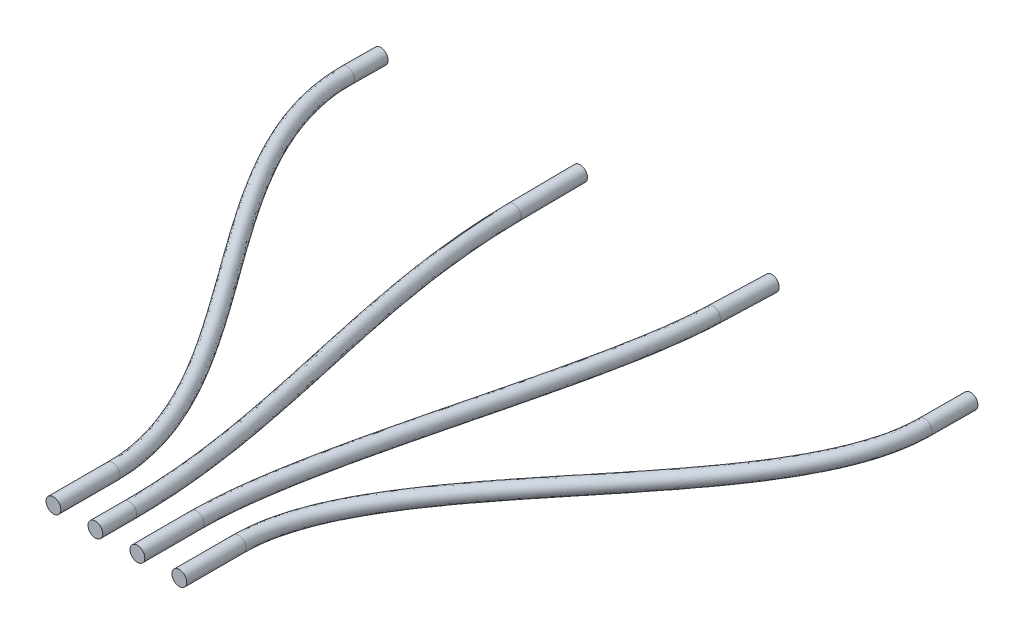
ISO-10303-21;
HEADER;
FILE_DESCRIPTION(('STEP AP214'),'2;1');
FILE_NAME('part.step','',(''),(''),'','','');
FILE_SCHEMA(('AUTOMOTIVE_DESIGN { 1 0 10303 214 1 1 1 1 }'));
ENDSEC;
DATA;
#1=APPLICATION_CONTEXT('core data for automotive mechanical design processes');
#2=APPLICATION_PROTOCOL_DEFINITION('international standard','automotive_design',2000,#1);
#3=PRODUCT_CONTEXT('',#1,'mechanical');
#4=PRODUCT('Part','Part','',(#3));
#5=PRODUCT_RELATED_PRODUCT_CATEGORY('part','',(#4));
#6=PRODUCT_DEFINITION_FORMATION('','',#4);
#7=PRODUCT_DEFINITION_CONTEXT('part definition',#1,'design');
#8=PRODUCT_DEFINITION('design','',#6,#7);
#9=PRODUCT_DEFINITION_SHAPE('','',#8);
#10=(LENGTH_UNIT() NAMED_UNIT(*) SI_UNIT(.MILLI.,.METRE.));
#11=(NAMED_UNIT(*) PLANE_ANGLE_UNIT() SI_UNIT($,.RADIAN.));
#12=(NAMED_UNIT(*) SI_UNIT($,.STERADIAN.) SOLID_ANGLE_UNIT());
#13=UNCERTAINTY_MEASURE_WITH_UNIT(LENGTH_MEASURE(1.E-05),#10,'distance_accuracy_value','');
#14=(GEOMETRIC_REPRESENTATION_CONTEXT(3) GLOBAL_UNCERTAINTY_ASSIGNED_CONTEXT((#13)) GLOBAL_UNIT_ASSIGNED_CONTEXT((#10,
#11,#12)) REPRESENTATION_CONTEXT('',''));
#15=CARTESIAN_POINT('',(0.,0.,0.));
#16=DIRECTION('',(0.,0.,1.));
#17=DIRECTION('',(1.,0.,0.));
#18=AXIS2_PLACEMENT_3D('',#15,#16,#17);
#19=CARTESIAN_POINT('',(-51.0028658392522,-15.3442769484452,-123.522168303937));
#20=DIRECTION('',(0.00760329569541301,-0.00227419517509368,-0.999968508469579));
#21=DIRECTION('',(-0.99997109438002,0.,-0.00760331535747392));
#22=AXIS2_PLACEMENT_3D('',#19,#20,#21);
#23=CYLINDRICAL_SURFACE('',#22,1.5875);
#24=CARTESIAN_POINT('',(-51.0028658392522,-15.3442769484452,-123.522168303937));
#25=DIRECTION('',(0.00760329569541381,-0.00227419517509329,-0.999968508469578));
#26=DIRECTION('',(-0.00892935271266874,0.999957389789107,-0.0023420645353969));
#27=AXIS2_PLACEMENT_3D('',#24,#25,#26);
#28=CIRCLE('',#27,1.5875);
#29=CARTESIAN_POINT('',(-52.5903199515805,-15.3442769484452,-123.534238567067));
#30=VERTEX_POINT('',#29);
#31=EDGE_CURVE('P0_E29',#30,#30,#28,.T.);
#32=CARTESIAN_POINT('',(-50.9484465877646,-15.3605541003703,-130.679267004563));
#33=DIRECTION('',(0.00760329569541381,-0.00227419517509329,-0.999968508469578));
#34=DIRECTION('',(-0.00892935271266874,0.999957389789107,-0.0023420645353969));
#35=AXIS2_PLACEMENT_3D('',#32,#33,#34);
#36=CIRCLE('',#35,1.5875);
#37=CARTESIAN_POINT('',(-52.5359007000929,-15.3605541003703,-130.691337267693));
#38=VERTEX_POINT('',#37);
#39=EDGE_CURVE('P0_E10',#38,#38,#36,.T.);
#40=CARTESIAN_POINT('',(-52.5903199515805,-15.3442769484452,-123.534238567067));
#41=CARTESIAN_POINT('',(-52.5897530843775,-15.3444465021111,-123.608791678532));
#42=CARTESIAN_POINT('',(-52.5891862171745,-15.344616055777,-123.683344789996));
#43=CARTESIAN_POINT('',(-52.5880524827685,-15.3449551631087,-123.832451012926));
#44=CARTESIAN_POINT('',(-52.5874856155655,-15.3451247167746,-123.907004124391));
#45=CARTESIAN_POINT('',(-52.5863518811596,-15.3454638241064,-124.056110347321));
#46=CARTESIAN_POINT('',(-52.5857850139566,-15.3456333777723,-124.130663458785));
#47=CARTESIAN_POINT('',(-52.5846512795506,-15.3459724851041,-124.279769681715));
#48=CARTESIAN_POINT('',(-52.5840844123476,-15.3461420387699,-124.35432279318));
#49=CARTESIAN_POINT('',(-52.5829506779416,-15.3464811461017,-124.50342901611));
#50=CARTESIAN_POINT('',(-52.5823838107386,-15.3466506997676,-124.577982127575));
#51=CARTESIAN_POINT('',(-52.5812500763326,-15.3469898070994,-124.727088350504));
#52=CARTESIAN_POINT('',(-52.5806832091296,-15.3471593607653,-124.801641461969));
#53=CARTESIAN_POINT('',(-52.5795494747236,-15.347498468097,-124.950747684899));
#54=CARTESIAN_POINT('',(-52.5789826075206,-15.3476680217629,-125.025300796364));
#55=CARTESIAN_POINT('',(-52.5778488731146,-15.3480071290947,-125.174407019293));
#56=CARTESIAN_POINT('',(-52.5772820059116,-15.3481766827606,-125.248960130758));
#57=CARTESIAN_POINT('',(-52.5761482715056,-15.3485157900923,-125.398066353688));
#58=CARTESIAN_POINT('',(-52.5755814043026,-15.3486853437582,-125.472619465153));
#59=CARTESIAN_POINT('',(-52.5744476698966,-15.34902445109,-125.621725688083));
#60=CARTESIAN_POINT('',(-52.5738808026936,-15.3491940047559,-125.696278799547));
#61=CARTESIAN_POINT('',(-52.5727470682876,-15.3495331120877,-125.845385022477));
#62=CARTESIAN_POINT('',(-52.5721802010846,-15.3497026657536,-125.919938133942));
#63=CARTESIAN_POINT('',(-52.5710464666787,-15.3500417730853,-126.069044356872));
#64=CARTESIAN_POINT('',(-52.5704795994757,-15.3502113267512,-126.143597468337));
#65=CARTESIAN_POINT('',(-52.5693458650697,-15.350550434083,-126.292703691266));
#66=CARTESIAN_POINT('',(-52.5687789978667,-15.3507199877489,-126.367256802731));
#67=CARTESIAN_POINT('',(-52.5676452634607,-15.3510590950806,-126.516363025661));
#68=CARTESIAN_POINT('',(-52.5670783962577,-15.3512286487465,-126.590916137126));
#69=CARTESIAN_POINT('',(-52.5659446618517,-15.3515677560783,-126.740022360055));
#70=CARTESIAN_POINT('',(-52.5653777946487,-15.3517373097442,-126.81457547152));
#71=CARTESIAN_POINT('',(-52.5642440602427,-15.352076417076,-126.96368169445));
#72=CARTESIAN_POINT('',(-52.5636771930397,-15.3522459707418,-127.038234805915));
#73=CARTESIAN_POINT('',(-52.5625434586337,-15.3525850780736,-127.187341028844));
#74=CARTESIAN_POINT('',(-52.5619765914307,-15.3527546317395,-127.261894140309));
#75=CARTESIAN_POINT('',(-52.5608428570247,-15.3530937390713,-127.411000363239));
#76=CARTESIAN_POINT('',(-52.5602759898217,-15.3532632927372,-127.485553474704));
#77=CARTESIAN_POINT('',(-52.5591422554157,-15.3536024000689,-127.634659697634));
#78=CARTESIAN_POINT('',(-52.5585753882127,-15.3537719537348,-127.709212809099));
#79=CARTESIAN_POINT('',(-52.5574416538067,-15.3541110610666,-127.858319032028));
#80=CARTESIAN_POINT('',(-52.5568747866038,-15.3542806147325,-127.932872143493));
#81=CARTESIAN_POINT('',(-52.5557410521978,-15.3546197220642,-128.081978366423));
#82=CARTESIAN_POINT('',(-52.5551741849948,-15.3547892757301,-128.156531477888));
#83=CARTESIAN_POINT('',(-52.5540404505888,-15.3551283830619,-128.305637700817));
#84=CARTESIAN_POINT('',(-52.5534735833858,-15.3552979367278,-128.380190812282));
#85=CARTESIAN_POINT('',(-52.5523398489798,-15.3556370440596,-128.529297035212));
#86=CARTESIAN_POINT('',(-52.5517729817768,-15.3558065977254,-128.603850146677));
#87=CARTESIAN_POINT('',(-52.5506392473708,-15.3561457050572,-128.752956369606));
#88=CARTESIAN_POINT('',(-52.5500723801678,-15.3563152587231,-128.827509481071));
#89=CARTESIAN_POINT('',(-52.5489386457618,-15.3566543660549,-128.976615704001));
#90=CARTESIAN_POINT('',(-52.5483717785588,-15.3568239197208,-129.051168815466));
#91=CARTESIAN_POINT('',(-52.5472380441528,-15.3571630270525,-129.200275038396));
#92=CARTESIAN_POINT('',(-52.5466711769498,-15.3573325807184,-129.27482814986));
#93=CARTESIAN_POINT('',(-52.5455374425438,-15.3576716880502,-129.42393437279));
#94=CARTESIAN_POINT('',(-52.5449705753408,-15.3578412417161,-129.498487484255));
#95=CARTESIAN_POINT('',(-52.5438368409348,-15.3581803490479,-129.647593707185));
#96=CARTESIAN_POINT('',(-52.5432699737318,-15.3583499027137,-129.72214681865));
#97=CARTESIAN_POINT('',(-52.5421362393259,-15.3586890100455,-129.871253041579));
#98=CARTESIAN_POINT('',(-52.5415693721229,-15.3588585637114,-129.945806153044));
#99=CARTESIAN_POINT('',(-52.5404356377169,-15.3591976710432,-130.094912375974));
#100=CARTESIAN_POINT('',(-52.5398687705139,-15.3593672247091,-130.169465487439));
#101=CARTESIAN_POINT('',(-52.5387350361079,-15.3597063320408,-130.318571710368));
#102=CARTESIAN_POINT('',(-52.5381681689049,-15.3598758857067,-130.393124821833));
#103=CARTESIAN_POINT('',(-52.5370344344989,-15.3602149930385,-130.542231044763));
#104=CARTESIAN_POINT('',(-52.5364675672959,-15.3603845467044,-130.616784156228));
#105=CARTESIAN_POINT('',(-52.5359007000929,-15.3605541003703,-130.691337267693));
#106=B_SPLINE_CURVE_WITH_KNOTS('',3,(#40,#41,#42,#43,#44,#45,#46,#47,#48,#49,#50,#51,#52,#53,
#54,#55,#56,#57,#58,#59,#60,#61,#62,#63,#64,#65,#66,#67,#68,#69,#70,#71,#72,#73,#74,#75,#76,#77,
#78,#79,#80,#81,#82,#83,#84,#85,#86,#87,#88,#89,#90,#91,#92,#93,#94,#95,#96,#97,#98,#99,#100,
#101,#102,#103,#104,#105),.UNSPECIFIED.,.F.,.F.,(4,2,2,2,2,2,2,2,2,2,2,2,2,2,2,2,2,2,2,2,2,2,2,
2,2,2,2,2,2,2,2,2,4),(0.,0.223666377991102,0.447332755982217,0.670999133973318,
0.894665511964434,1.11833188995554,1.34199826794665,1.56566464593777,1.78933102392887,
2.01299740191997,2.23666377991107,2.4603301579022,2.6839965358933,2.9076629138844,
3.13132929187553,3.35499566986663,3.57866204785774,3.80232842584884,4.02599480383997,
4.24966118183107,4.47332755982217,4.69699393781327,4.9206603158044,5.1443266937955,
5.3679930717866,5.59165944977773,5.81532582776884,6.03899220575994,6.26265858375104,
6.48632496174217,6.70999133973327,6.93365771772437,7.15732409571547),.UNSPECIFIED.);
#107=EDGE_CURVE('P0_BSEAM14',#30,#38,#106,.T.);
#108=ORIENTED_EDGE('',*,*,#31,.T.);
#109=ORIENTED_EDGE('',*,*,#39,.F.);
#110=ORIENTED_EDGE('',*,*,#107,.T.);
#111=ORIENTED_EDGE('',*,*,#107,.F.);
#112=EDGE_LOOP('',(#108,#110,#109,#111));
#113=FACE_BOUND('',#112,.T.);
#114=ADVANCED_FACE('P0_F14',(#113),#23,.T.);
#115=CARTESIAN_POINT('',(-2.59160984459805,-15.3316908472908,-24.8388681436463));
#116=DIRECTION('',(0.,0.,1.));
#117=DIRECTION('',(0.,-1.,0.));
#118=AXIS2_PLACEMENT_3D('',#115,#116,#117);
#119=CYLINDRICAL_SURFACE('',#118,1.5875);
#120=CARTESIAN_POINT('',(-2.59160984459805,-15.3316908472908,-24.8388681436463));
#121=DIRECTION('',(0.,0.,-1.));
#122=DIRECTION('',(0.,1.,0.));
#123=AXIS2_PLACEMENT_3D('',#120,#121,#122);
#124=CIRCLE('',#123,1.5875);
#125=CARTESIAN_POINT('',(-2.59160984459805,-13.7441908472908,-24.8388681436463));
#126=VERTEX_POINT('',#125);
#127=EDGE_CURVE('P0_E20',#126,#126,#124,.T.);
#128=ORIENTED_EDGE('',*,*,#127,.F.);
#129=EDGE_LOOP('',(#128));
#130=FACE_BOUND('',#129,.T.);
#131=CARTESIAN_POINT('',(-2.59160984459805,-15.3316908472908,-12.1388681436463));
#132=DIRECTION('',(0.,0.,-1.));
#133=DIRECTION('',(0.,1.,0.));
#134=AXIS2_PLACEMENT_3D('',#131,#132,#133);
#135=CIRCLE('',#134,1.5875);
#136=CARTESIAN_POINT('',(-2.59160984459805,-13.7441908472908,-12.1388681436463));
#137=VERTEX_POINT('',#136);
#138=EDGE_CURVE('P0_E24',#137,#137,#135,.T.);
#139=ORIENTED_EDGE('',*,*,#138,.T.);
#140=EDGE_LOOP('',(#139));
#141=FACE_BOUND('',#140,.T.);
#142=ADVANCED_FACE('P0_F50',(#130,#141),#119,.T.);
#143=CARTESIAN_POINT('',(-2.59160984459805,-15.3316908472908,-12.1388681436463));
#144=DIRECTION('',(0.,0.,-1.));
#145=DIRECTION('',(0.,1.,0.));
#146=AXIS2_PLACEMENT_3D('',#143,#144,#145);
#147=PLANE('',#146);
#148=ORIENTED_EDGE('',*,*,#138,.F.);
#149=EDGE_LOOP('',(#148));
#150=FACE_BOUND('',#149,.T.);
#151=ADVANCED_FACE('P0_F45',(#150),#147,.F.);
#152=CARTESIAN_POINT('',(-50.9484465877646,-15.3605541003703,-130.679267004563));
#153=DIRECTION('',(0.00760329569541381,-0.00227419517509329,-0.999968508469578));
#154=DIRECTION('',(-0.00892935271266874,0.999957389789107,-0.0023420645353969));
#155=AXIS2_PLACEMENT_3D('',#152,#153,#154);
#156=PLANE('',#155);
#157=ORIENTED_EDGE('',*,*,#39,.T.);
#158=EDGE_LOOP('',(#157));
#159=FACE_BOUND('',#158,.T.);
#160=ADVANCED_FACE('P0_F38',(#159),#156,.T.);
#161=CARTESIAN_POINT('',(-2.59160984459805,-13.7441908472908,-24.8388681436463));
#162=CARTESIAN_POINT('',(-2.59160984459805,-13.7441908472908,-28.1353083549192));
#163=CARTESIAN_POINT('',(-3.65517730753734,-13.7428984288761,-34.8163931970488));
#164=CARTESIAN_POINT('',(-7.77123618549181,-13.7383826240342,-45.0500758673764));
#165=CARTESIAN_POINT('',(-16.4433232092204,-13.7299835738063,-60.1368144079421));
#166=CARTESIAN_POINT('',(-28.1307038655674,-13.7215168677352,-75.657954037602));
#167=CARTESIAN_POINT('',(-38.9856117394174,-13.7209036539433,-91.2689707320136));
#168=CARTESIAN_POINT('',(-45.4436834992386,-13.7253792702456,-102.223252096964));
#169=CARTESIAN_POINT('',(-49.9121328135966,-13.7363223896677,-113.011315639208));
#170=CARTESIAN_POINT('',(-51.0434243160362,-13.7489532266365,-120.056035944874));
#171=CARTESIAN_POINT('',(-51.0170411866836,-13.756844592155,-123.525886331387));
#172=CARTESIAN_POINT('',(0.583390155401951,-13.7441908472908,-24.8388681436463));
#173=CARTESIAN_POINT('',(0.583390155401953,-13.7441908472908,-28.1358404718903));
#174=CARTESIAN_POINT('',(-0.589529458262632,-13.7419523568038,-35.8952688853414));
#175=CARTESIAN_POINT('',(-4.92826031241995,-13.7370537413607,-46.4424806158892));
#176=CARTESIAN_POINT('',(-13.8430788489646,-13.720692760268,-62.005198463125));
#177=CARTESIAN_POINT('',(-25.593865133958,-13.7298396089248,-77.5545677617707));
#178=CARTESIAN_POINT('',(-36.3276067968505,-13.6959335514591,-93.0228341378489));
#179=CARTESIAN_POINT('',(-42.6181824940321,-13.701798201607,-103.645287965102));
#180=CARTESIAN_POINT('',(-46.8509409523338,-13.7105498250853,-114.122681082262));
#181=CARTESIAN_POINT('',(-47.868601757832,-13.7205591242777,-120.037342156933));
#182=CARTESIAN_POINT('',(-47.8422595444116,-13.7284382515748,-123.501811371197));
#183=CARTESIAN_POINT('',(0.583390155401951,-16.9191908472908,-24.8388681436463));
#184=CARTESIAN_POINT('',(0.583390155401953,-16.9191908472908,-28.1358404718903));
#185=CARTESIAN_POINT('',(-0.588879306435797,-16.9169516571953,-35.8967358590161));
#186=CARTESIAN_POINT('',(-4.92765503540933,-16.9120547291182,-46.4442280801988));
#187=CARTESIAN_POINT('',(-13.8362122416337,-16.8956782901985,-62.0116212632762));
#188=CARTESIAN_POINT('',(-25.6015232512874,-16.9048871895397,-77.5508257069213));
#189=CARTESIAN_POINT('',(-36.3065926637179,-16.8708518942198,-93.0365888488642));
#190=CARTESIAN_POINT('',(-42.5963156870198,-16.876705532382,-103.653917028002));
#191=CARTESIAN_POINT('',(-46.8243838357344,-16.8854459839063,-114.128766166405));
#192=CARTESIAN_POINT('',(-47.8402510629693,-16.8954238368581,-120.029906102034));
#193=CARTESIAN_POINT('',(-47.8139088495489,-16.9033029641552,-123.494375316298));
#194=CARTESIAN_POINT('',(-2.59160984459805,-16.9191908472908,-24.8388681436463));
#195=CARTESIAN_POINT('',(-2.59160984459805,-16.9191908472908,-28.1355744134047));
#196=CARTESIAN_POINT('',(-3.65452715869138,-16.917897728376,-34.8177365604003));
#197=CARTESIAN_POINT('',(-7.77063089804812,-16.9133836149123,-45.0518568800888));
#198=CARTESIAN_POINT('',(-16.436456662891,-16.9049690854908,-60.1432066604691));
#199=CARTESIAN_POINT('',(-28.1383615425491,-16.8965645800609,-75.6542732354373));
#200=CARTESIAN_POINT('',(-38.9645982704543,-16.8958217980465,-91.2826375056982));
#201=CARTESIAN_POINT('',(-45.4218141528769,-16.9002873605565,-102.232215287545));
#202=CARTESIAN_POINT('',(-49.8855851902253,-16.9112157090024,-113.016152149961));
#203=CARTESIAN_POINT('',(-51.0150531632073,-16.9238240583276,-120.051290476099));
#204=CARTESIAN_POINT('',(-50.9886904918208,-16.9317093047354,-123.518450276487));
#205=CARTESIAN_POINT('',(-5.76660984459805,-16.9191908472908,-24.8388681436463));
#206=CARTESIAN_POINT('',(-5.76660984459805,-16.9191908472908,-28.1353083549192));
#207=CARTESIAN_POINT('',(-6.72017501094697,-16.9188437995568,-33.7387372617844));
#208=CARTESIAN_POINT('',(-10.6136067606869,-16.9147125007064,-43.6594856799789));
#209=CARTESIAN_POINT('',(-19.0367010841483,-16.9142598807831,-58.274792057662));
#210=CARTESIAN_POINT('',(-30.6751998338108,-16.8882419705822,-73.7577207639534));
#211=CARTESIAN_POINT('',(-41.6226038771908,-16.9207917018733,-89.5286861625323));
#212=CARTESIAN_POINT('',(-48.247312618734,-16.923869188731,-100.810513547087));
#213=CARTESIAN_POINT('',(-52.9467865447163,-16.9369854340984,-111.903538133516));
#214=CARTESIAN_POINT('',(-54.1898552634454,-16.9522242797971,-120.072674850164));
#215=CARTESIAN_POINT('',(-54.1634721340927,-16.9601156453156,-123.542525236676));
#216=CARTESIAN_POINT('',(-5.76660984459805,-13.7441908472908,-24.8388681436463));
#217=CARTESIAN_POINT('',(-5.76660984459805,-13.7441908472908,-28.134776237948));
#218=CARTESIAN_POINT('',(-6.72082515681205,-13.7438445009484,-33.7375175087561));
#219=CARTESIAN_POINT('',(-10.6142120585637,-13.7397115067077,-43.6576711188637));
#220=CARTESIAN_POINT('',(-19.0435675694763,-13.7392743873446,-58.2684303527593));
#221=CARTESIAN_POINT('',(-30.6675425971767,-13.7131941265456,-73.7613403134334));
#222=CARTESIAN_POINT('',(-41.6436166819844,-13.7458737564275,-89.5151073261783));
#223=CARTESIAN_POINT('',(-48.269184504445,-13.7489603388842,-100.801216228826));
#224=CARTESIAN_POINT('',(-52.9733246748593,-13.7620949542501,-111.899950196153));
#225=CARTESIAN_POINT('',(-54.2182468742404,-13.7773473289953,-120.074729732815));
#226=CARTESIAN_POINT('',(-54.1918228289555,-13.7852509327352,-123.549961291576));
#227=CARTESIAN_POINT('',(-2.59160984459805,-13.7441908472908,-24.8388681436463));
#228=CARTESIAN_POINT('',(-2.59160984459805,-13.7441908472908,-28.1353083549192));
#229=CARTESIAN_POINT('',(-3.65517730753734,-13.7428984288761,-34.8163931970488));
#230=CARTESIAN_POINT('',(-7.77123618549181,-13.7383826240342,-45.0500758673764));
#231=CARTESIAN_POINT('',(-16.4433232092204,-13.7299835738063,-60.1368144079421));
#232=CARTESIAN_POINT('',(-28.1307038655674,-13.7215168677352,-75.657954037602));
#233=CARTESIAN_POINT('',(-38.9856117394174,-13.7209036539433,-91.2689707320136));
#234=CARTESIAN_POINT('',(-45.4436834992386,-13.7253792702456,-102.223252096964));
#235=CARTESIAN_POINT('',(-49.9121328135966,-13.7363223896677,-113.011315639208));
#236=CARTESIAN_POINT('',(-51.0434243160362,-13.7489532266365,-120.056035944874));
#237=CARTESIAN_POINT('',(-51.0170411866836,-13.756844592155,-123.525886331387));
#238=(BOUNDED_SURFACE() B_SPLINE_SURFACE(3,3,((#161,#162,#163,#164,#165,#166,#167,#168,#169,
#170,#171),(#172,#173,#174,#175,#176,#177,#178,#179,#180,#181,#182),(#183,#184,#185,#186,#187,
#188,#189,#190,#191,#192,#193),(#194,#195,#196,#197,#198,#199,#200,#201,#202,#203,#204),(#205,
#206,#207,#208,#209,#210,#211,#212,#213,#214,#215),(#216,#217,#218,#219,#220,#221,#222,#223,
#224,#225,#226),(#227,#228,#229,#230,#231,#232,#233,#234,#235,#236,#237)),.UNSPECIFIED.,.T.,.F.,
.F.) B_SPLINE_SURFACE_WITH_KNOTS((4,3,4),(4,1,1,1,1,1,1,1,4),(0.,0.5,1.),(0.,0.104533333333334,
0.209066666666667,0.3136,0.56,0.67,0.78,0.889999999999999,1.),
.UNSPECIFIED.) GEOMETRIC_REPRESENTATION_ITEM() RATIONAL_B_SPLINE_SURFACE(((1.,1.,1.,1.,1.,1.,1.,
1.,1.,1.,1.),(0.333333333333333,0.333333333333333,0.333333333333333,0.333333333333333,
0.333333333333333,0.333333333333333,0.333333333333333,0.333333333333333,0.333333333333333,
0.333333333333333,0.333333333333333),(0.333333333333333,0.333333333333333,0.333333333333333,
0.333333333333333,0.333333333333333,0.333333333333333,0.333333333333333,0.333333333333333,
0.333333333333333,0.333333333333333,0.333333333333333),(1.,1.,1.,1.,1.,1.,1.,1.,1.,1.,1.),
(0.333333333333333,0.333333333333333,0.333333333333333,0.333333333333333,0.333333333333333,
0.333333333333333,0.333333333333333,0.333333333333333,0.333333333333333,0.333333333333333,
0.333333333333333),(0.333333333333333,0.333333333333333,0.333333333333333,0.333333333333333,
0.333333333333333,0.333333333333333,0.333333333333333,0.333333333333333,0.333333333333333,
0.333333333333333,0.333333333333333),(1.,1.,1.,1.,1.,1.,1.,1.,1.,1.,1.))) REPRESENTATION_ITEM('') SURFACE());
#239=ORIENTED_EDGE('',*,*,#127,.T.);
#240=EDGE_LOOP('',(#239));
#241=FACE_BOUND('',#240,.T.);
#242=ORIENTED_EDGE('',*,*,#31,.F.);
#243=EDGE_LOOP('',(#242));
#244=FACE_BOUND('',#243,.T.);
#245=ADVANCED_FACE('P0_F36',(#241,#244),#238,.T.);
#246=CLOSED_SHELL('',(#114,#142,#151,#160,#245));
#247=MANIFOLD_SOLID_BREP('P0_B1',#246);
#248=CARTESIAN_POINT('',(-8.85126217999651,-16.5240264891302,-117.068458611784));
#249=DIRECTION('',(-0.00307136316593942,0.00656084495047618,-0.999973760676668));
#250=DIRECTION('',(0.,0.999978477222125,0.0065608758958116));
#251=AXIS2_PLACEMENT_3D('',#248,#249,#250);
#252=CYLINDRICAL_SURFACE('',#251,1.5875);
#253=CARTESIAN_POINT('',(-8.85126217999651,-16.5240264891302,-117.068458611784));
#254=DIRECTION('',(-0.0030713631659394,0.00656084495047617,-0.999973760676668));
#255=DIRECTION('',(-0.997798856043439,0.0662208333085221,0.00349915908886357));
#256=AXIS2_PLACEMENT_3D('',#253,#254,#255);
#257=CIRCLE('',#256,1.5875);
#258=CARTESIAN_POINT('',(-10.4352678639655,-16.4189009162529,-117.06290369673));
#259=VERTEX_POINT('',#258);
#260=EDGE_CURVE('P1_E37',#259,#259,#257,.T.);
#261=ORIENTED_EDGE('',*,*,#260,.T.);
#262=EDGE_LOOP('',(#261));
#263=FACE_BOUND('',#262,.T.);
#264=CARTESIAN_POINT('',(-8.89511291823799,-16.4303554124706,-131.345372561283));
#265=DIRECTION('',(-0.0030713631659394,0.00656084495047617,-0.999973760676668));
#266=DIRECTION('',(-0.997798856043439,0.0662208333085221,0.00349915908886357));
#267=AXIS2_PLACEMENT_3D('',#264,#265,#266);
#268=CIRCLE('',#267,1.5875);
#269=CARTESIAN_POINT('',(-10.479118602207,-16.3252298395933,-131.339817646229));
#270=VERTEX_POINT('',#269);
#271=EDGE_CURVE('P1_E12',#270,#270,#268,.T.);
#272=ORIENTED_EDGE('',*,*,#271,.F.);
#273=EDGE_LOOP('',(#272));
#274=FACE_BOUND('',#273,.T.);
#275=ADVANCED_FACE('P1_F22',(#263,#274),#252,.T.);
#276=CARTESIAN_POINT('',(6.40839000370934,-15.3300384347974,-19.4029398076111));
#277=DIRECTION('',(0.,0.,1.));
#278=DIRECTION('',(1.,0.,0.));
#279=AXIS2_PLACEMENT_3D('',#276,#277,#278);
#280=CYLINDRICAL_SURFACE('',#279,1.5875);
#281=CARTESIAN_POINT('',(6.40839000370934,-15.3300384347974,-19.4029398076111));
#282=DIRECTION('',(0.,0.,-1.));
#283=DIRECTION('',(-1.,0.,0.));
#284=AXIS2_PLACEMENT_3D('',#281,#282,#283);
#285=CIRCLE('',#284,1.5875);
#286=CARTESIAN_POINT('',(7.99589000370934,-15.3300384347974,-19.4029398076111));
#287=VERTEX_POINT('',#286);
#288=EDGE_CURVE('P1_E28',#287,#287,#285,.T.);
#289=CARTESIAN_POINT('',(6.40839000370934,-15.3300384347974,-12.1388681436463));
#290=DIRECTION('',(0.,0.,-1.));
#291=DIRECTION('',(-1.,0.,0.));
#292=AXIS2_PLACEMENT_3D('',#289,#290,#291);
#293=CIRCLE('',#292,1.5875);
#294=CARTESIAN_POINT('',(7.99589000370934,-15.3300384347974,-12.1388681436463));
#295=VERTEX_POINT('',#294);
#296=EDGE_CURVE('P1_E32',#295,#295,#293,.T.);
#297=CARTESIAN_POINT('',(7.99589000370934,-15.3300384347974,-19.4029398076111));
#298=CARTESIAN_POINT('',(7.99589000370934,-15.3300384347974,-19.3272723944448));
#299=CARTESIAN_POINT('',(7.99589000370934,-15.3300384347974,-19.2516049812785));
#300=CARTESIAN_POINT('',(7.99589000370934,-15.3300384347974,-19.1002701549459));
#301=CARTESIAN_POINT('',(7.99589000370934,-15.3300384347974,-19.0246027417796));
#302=CARTESIAN_POINT('',(7.99589000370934,-15.3300384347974,-18.873267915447));
#303=CARTESIAN_POINT('',(7.99589000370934,-15.3300384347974,-18.7976005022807));
#304=CARTESIAN_POINT('',(7.99589000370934,-15.3300384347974,-18.6462656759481));
#305=CARTESIAN_POINT('',(7.99589000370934,-15.3300384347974,-18.5705982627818));
#306=CARTESIAN_POINT('',(7.99589000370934,-15.3300384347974,-18.4192634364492));
#307=CARTESIAN_POINT('',(7.99589000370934,-15.3300384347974,-18.3435960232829));
#308=CARTESIAN_POINT('',(7.99589000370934,-15.3300384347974,-18.1922611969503));
#309=CARTESIAN_POINT('',(7.99589000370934,-15.3300384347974,-18.116593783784));
#310=CARTESIAN_POINT('',(7.99589000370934,-15.3300384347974,-17.9652589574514));
#311=CARTESIAN_POINT('',(7.99589000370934,-15.3300384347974,-17.8895915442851));
#312=CARTESIAN_POINT('',(7.99589000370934,-15.3300384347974,-17.7382567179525));
#313=CARTESIAN_POINT('',(7.99589000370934,-15.3300384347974,-17.6625893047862));
#314=CARTESIAN_POINT('',(7.99589000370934,-15.3300384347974,-17.5112544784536));
#315=CARTESIAN_POINT('',(7.99589000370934,-15.3300384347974,-17.4355870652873));
#316=CARTESIAN_POINT('',(7.99589000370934,-15.3300384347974,-17.2842522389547));
#317=CARTESIAN_POINT('',(7.99589000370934,-15.3300384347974,-17.2085848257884));
#318=CARTESIAN_POINT('',(7.99589000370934,-15.3300384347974,-17.0572499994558));
#319=CARTESIAN_POINT('',(7.99589000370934,-15.3300384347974,-16.9815825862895));
#320=CARTESIAN_POINT('',(7.99589000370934,-15.3300384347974,-16.8302477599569));
#321=CARTESIAN_POINT('',(7.99589000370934,-15.3300384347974,-16.7545803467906));
#322=CARTESIAN_POINT('',(7.99589000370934,-15.3300384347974,-16.603245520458));
#323=CARTESIAN_POINT('',(7.99589000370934,-15.3300384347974,-16.5275781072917));
#324=CARTESIAN_POINT('',(7.99589000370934,-15.3300384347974,-16.3762432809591));
#325=CARTESIAN_POINT('',(7.99589000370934,-15.3300384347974,-16.3005758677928));
#326=CARTESIAN_POINT('',(7.99589000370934,-15.3300384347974,-16.1492410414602));
#327=CARTESIAN_POINT('',(7.99589000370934,-15.3300384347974,-16.0735736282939));
#328=CARTESIAN_POINT('',(7.99589000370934,-15.3300384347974,-15.9222388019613));
#329=CARTESIAN_POINT('',(7.99589000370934,-15.3300384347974,-15.846571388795));
#330=CARTESIAN_POINT('',(7.99589000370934,-15.3300384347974,-15.6952365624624));
#331=CARTESIAN_POINT('',(7.99589000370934,-15.3300384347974,-15.6195691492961));
#332=CARTESIAN_POINT('',(7.99589000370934,-15.3300384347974,-15.4682343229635));
#333=CARTESIAN_POINT('',(7.99589000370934,-15.3300384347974,-15.3925669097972));
#334=CARTESIAN_POINT('',(7.99589000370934,-15.3300384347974,-15.2412320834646));
#335=CARTESIAN_POINT('',(7.99589000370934,-15.3300384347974,-15.1655646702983));
#336=CARTESIAN_POINT('',(7.99589000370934,-15.3300384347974,-15.0142298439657));
#337=CARTESIAN_POINT('',(7.99589000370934,-15.3300384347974,-14.9385624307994));
#338=CARTESIAN_POINT('',(7.99589000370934,-15.3300384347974,-14.7872276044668));
#339=CARTESIAN_POINT('',(7.99589000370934,-15.3300384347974,-14.7115601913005));
#340=CARTESIAN_POINT('',(7.99589000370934,-15.3300384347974,-14.5602253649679));
#341=CARTESIAN_POINT('',(7.99589000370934,-15.3300384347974,-14.4845579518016));
#342=CARTESIAN_POINT('',(7.99589000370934,-15.3300384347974,-14.333223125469));
#343=CARTESIAN_POINT('',(7.99589000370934,-15.3300384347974,-14.2575557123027));
#344=CARTESIAN_POINT('',(7.99589000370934,-15.3300384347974,-14.1062208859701));
#345=CARTESIAN_POINT('',(7.99589000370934,-15.3300384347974,-14.0305534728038));
#346=CARTESIAN_POINT('',(7.99589000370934,-15.3300384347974,-13.8792186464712));
#347=CARTESIAN_POINT('',(7.99589000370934,-15.3300384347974,-13.8035512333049));
#348=CARTESIAN_POINT('',(7.99589000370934,-15.3300384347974,-13.6522164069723));
#349=CARTESIAN_POINT('',(7.99589000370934,-15.3300384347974,-13.576548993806));
#350=CARTESIAN_POINT('',(7.99589000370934,-15.3300384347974,-13.4252141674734));
#351=CARTESIAN_POINT('',(7.99589000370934,-15.3300384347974,-13.3495467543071));
#352=CARTESIAN_POINT('',(7.99589000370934,-15.3300384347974,-13.1982119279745));
#353=CARTESIAN_POINT('',(7.99589000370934,-15.3300384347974,-13.1225445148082));
#354=CARTESIAN_POINT('',(7.99589000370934,-15.3300384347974,-12.9712096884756));
#355=CARTESIAN_POINT('',(7.99589000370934,-15.3300384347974,-12.8955422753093));
#356=CARTESIAN_POINT('',(7.99589000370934,-15.3300384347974,-12.7442074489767));
#357=CARTESIAN_POINT('',(7.99589000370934,-15.3300384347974,-12.6685400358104));
#358=CARTESIAN_POINT('',(7.99589000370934,-15.3300384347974,-12.5172052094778));
#359=CARTESIAN_POINT('',(7.99589000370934,-15.3300384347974,-12.4415377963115));
#360=CARTESIAN_POINT('',(7.99589000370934,-15.3300384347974,-12.2902029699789));
#361=CARTESIAN_POINT('',(7.99589000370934,-15.3300384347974,-12.2145355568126));
#362=CARTESIAN_POINT('',(7.99589000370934,-15.3300384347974,-12.1388681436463));
#363=B_SPLINE_CURVE_WITH_KNOTS('',3,(#297,#298,#299,#300,#301,#302,#303,#304,#305,#306,#307,
#308,#309,#310,#311,#312,#313,#314,#315,#316,#317,#318,#319,#320,#321,#322,#323,#324,#325,#326,
#327,#328,#329,#330,#331,#332,#333,#334,#335,#336,#337,#338,#339,#340,#341,#342,#343,#344,#345,
#346,#347,#348,#349,#350,#351,#352,#353,#354,#355,#356,#357,#358,#359,#360,#361,#362),
.UNSPECIFIED.,.F.,.F.,(4,2,2,2,2,2,2,2,2,2,2,2,2,2,2,2,2,2,2,2,2,2,2,2,2,2,2,2,2,2,2,2,4),(0.,
0.227002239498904,0.454004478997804,0.681006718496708,0.908008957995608,1.13501119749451,
1.36201343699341,1.58901567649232,1.81601791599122,2.04302015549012,2.27002239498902,
2.49702463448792,2.72402687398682,2.95102911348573,3.17803135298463,3.40503359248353,
3.63203583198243,3.85903807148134,4.08604031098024,4.31304255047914,4.54004478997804,
4.76704702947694,4.99404926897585,5.22105150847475,5.44805374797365,5.67505598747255,
5.90205822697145,6.12906046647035,6.35606270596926,6.58306494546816,6.81006718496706,
7.03706942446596,7.26407166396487),.UNSPECIFIED.);
#364=EDGE_CURVE('P1_BSEAM58',#287,#295,#363,.T.);
#365=ORIENTED_EDGE('',*,*,#288,.F.);
#366=ORIENTED_EDGE('',*,*,#296,.T.);
#367=ORIENTED_EDGE('',*,*,#364,.T.);
#368=ORIENTED_EDGE('',*,*,#364,.F.);
#369=EDGE_LOOP('',(#365,#367,#366,#368));
#370=FACE_BOUND('',#369,.T.);
#371=ADVANCED_FACE('P1_F58',(#370),#280,.T.);
#372=CARTESIAN_POINT('',(6.40839000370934,-15.3300384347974,-12.1388681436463));
#373=DIRECTION('',(0.,0.,-1.));
#374=DIRECTION('',(-1.,0.,0.));
#375=AXIS2_PLACEMENT_3D('',#372,#373,#374);
#376=PLANE('',#375);
#377=ORIENTED_EDGE('',*,*,#296,.F.);
#378=EDGE_LOOP('',(#377));
#379=FACE_BOUND('',#378,.T.);
#380=ADVANCED_FACE('P1_F53',(#379),#376,.F.);
#381=CARTESIAN_POINT('',(-8.89511291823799,-16.4303554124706,-131.345372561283));
#382=DIRECTION('',(-0.0030713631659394,0.00656084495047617,-0.999973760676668));
#383=DIRECTION('',(-0.997798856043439,0.0662208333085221,0.00349915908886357));
#384=AXIS2_PLACEMENT_3D('',#381,#382,#383);
#385=PLANE('',#384);
#386=ORIENTED_EDGE('',*,*,#271,.T.);
#387=EDGE_LOOP('',(#386));
#388=FACE_BOUND('',#387,.T.);
#389=ADVANCED_FACE('P1_F46',(#388),#385,.T.);
#390=CARTESIAN_POINT('',(4.82089000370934,-15.3300384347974,-19.4029398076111));
#391=CARTESIAN_POINT('',(4.82089000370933,-15.3300384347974,-28.6663691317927));
#392=CARTESIAN_POINT('',(2.4772681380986,-15.5148223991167,-46.5434738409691));
#393=CARTESIAN_POINT('',(-3.74402174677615,-16.1232137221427,-71.7392001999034));
#394=CARTESIAN_POINT('',(-8.88932191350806,-16.3875025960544,-95.0607993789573));
#395=CARTESIAN_POINT('',(-10.4129147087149,-16.4666502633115,-109.785168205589));
#396=CARTESIAN_POINT('',(-10.4352678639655,-16.418900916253,-117.06290369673));
#397=CARTESIAN_POINT('',(4.82089000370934,-12.1550384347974,-19.4029398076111));
#398=CARTESIAN_POINT('',(4.82089000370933,-12.1550384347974,-28.9617250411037));
#399=CARTESIAN_POINT('',(2.53719770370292,-12.3415244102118,-46.4790436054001));
#400=CARTESIAN_POINT('',(-3.79904296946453,-12.9463340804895,-71.8590022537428));
#401=CARTESIAN_POINT('',(-8.65356405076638,-13.2208163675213,-95.0425858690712));
#402=CARTESIAN_POINT('',(-10.203355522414,-13.2970658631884,-110.012252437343));
#403=CARTESIAN_POINT('',(-10.224949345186,-13.2509385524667,-117.042764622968));
#404=CARTESIAN_POINT('',(7.99589000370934,-12.1550384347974,-19.4029398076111));
#405=CARTESIAN_POINT('',(7.99589000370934,-12.1550384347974,-28.9617250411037));
#406=CARTESIAN_POINT('',(5.64587791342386,-12.4144556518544,-47.2822901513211));
#407=CARTESIAN_POINT('',(-0.720182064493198,-12.9081080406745,-72.5811049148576));
#408=CARTESIAN_POINT('',(-5.52839855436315,-13.4651652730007,-95.6972639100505));
#409=CARTESIAN_POINT('',(-7.03534415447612,-13.507317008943,-110.02336226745));
#410=CARTESIAN_POINT('',(-7.05693797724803,-13.4611896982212,-117.053874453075));
#411=CARTESIAN_POINT('',(7.99589000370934,-15.3300384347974,-19.4029398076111));
#412=CARTESIAN_POINT('',(7.99589000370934,-15.3300384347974,-28.8140470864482));
#413=CARTESIAN_POINT('',(5.58596767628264,-15.587794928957,-47.271229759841));
#414=CARTESIAN_POINT('',(-0.665222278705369,-16.0848564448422,-72.4955609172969));
#415=CARTESIAN_POINT('',(-5.76398177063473,-16.6322245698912,-95.6549693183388));
#416=CARTESIAN_POINT('',(-7.24528300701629,-16.6760903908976,-109.919889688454));
#417=CARTESIAN_POINT('',(-7.26725649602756,-16.6291520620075,-117.074013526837));
#418=CARTESIAN_POINT('',(7.99589000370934,-18.5050384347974,-19.4029398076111));
#419=CARTESIAN_POINT('',(7.99589000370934,-18.5050384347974,-28.6663691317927));
#420=CARTESIAN_POINT('',(5.52605743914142,-18.7611342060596,-47.2601693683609));
#421=CARTESIAN_POINT('',(-0.61026249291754,-19.2616048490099,-72.4100169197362));
#422=CARTESIAN_POINT('',(-5.99956498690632,-19.7992838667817,-95.612674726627));
#423=CARTESIAN_POINT('',(-7.45522185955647,-19.8448637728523,-109.816417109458));
#424=CARTESIAN_POINT('',(-7.47757501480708,-19.7971144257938,-117.094152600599));
#425=CARTESIAN_POINT('',(4.82089000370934,-18.5050384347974,-19.4029398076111));
#426=CARTESIAN_POINT('',(4.82089000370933,-18.5050384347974,-28.3710132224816));
#427=CARTESIAN_POINT('',(2.41733857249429,-18.6881203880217,-46.6079040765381));
#428=CARTESIAN_POINT('',(-3.68900052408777,-19.3000933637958,-71.6193981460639));
#429=CARTESIAN_POINT('',(-9.12507977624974,-19.5541888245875,-95.0790128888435));
#430=CARTESIAN_POINT('',(-10.6224738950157,-19.6362346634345,-109.558083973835));
#431=CARTESIAN_POINT('',(-10.645586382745,-19.5868632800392,-117.083042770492));
#432=CARTESIAN_POINT('',(4.82089000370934,-15.3300384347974,-19.4029398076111));
#433=CARTESIAN_POINT('',(4.82089000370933,-15.3300384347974,-28.6663691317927));
#434=CARTESIAN_POINT('',(2.4772681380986,-15.5148223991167,-46.5434738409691));
#435=CARTESIAN_POINT('',(-3.74402174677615,-16.1232137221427,-71.7392001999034));
#436=CARTESIAN_POINT('',(-8.88932191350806,-16.3875025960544,-95.0607993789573));
#437=CARTESIAN_POINT('',(-10.4129147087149,-16.4666502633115,-109.785168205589));
#438=CARTESIAN_POINT('',(-10.4352678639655,-16.418900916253,-117.06290369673));
#439=(BOUNDED_SURFACE() B_SPLINE_SURFACE(3,3,((#390,#391,#392,#393,#394,#395,#396),(#397,#398,
#399,#400,#401,#402,#403),(#404,#405,#406,#407,#408,#409,#410),(#411,#412,#413,#414,#415,#416,
#417),(#418,#419,#420,#421,#422,#423,#424),(#425,#426,#427,#428,#429,#430,#431),(#432,#433,#434,
#435,#436,#437,#438)),.UNSPECIFIED.,.T.,.F.,.F.) B_SPLINE_SURFACE_WITH_KNOTS((4,3,4),(4,1,1,1,
4),(0.,0.5,1.),(0.,0.28,0.56,0.779999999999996,1.),
.UNSPECIFIED.) GEOMETRIC_REPRESENTATION_ITEM() RATIONAL_B_SPLINE_SURFACE(((1.,1.,1.,1.,1.,1.,
1.),(0.333333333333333,0.333333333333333,0.333333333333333,0.333333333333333,0.333333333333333,
0.333333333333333,0.333333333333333),(0.333333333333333,0.333333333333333,0.333333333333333,
0.333333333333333,0.333333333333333,0.333333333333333,0.333333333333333),(1.,1.,1.,1.,1.,1.,1.),
(0.333333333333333,0.333333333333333,0.333333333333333,0.333333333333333,0.333333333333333,
0.333333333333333,0.333333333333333),(0.333333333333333,0.333333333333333,0.333333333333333,
0.333333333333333,0.333333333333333,0.333333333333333,0.333333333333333),(1.,1.,1.,1.,1.,1.,1.))) REPRESENTATION_ITEM('') SURFACE());
#440=ORIENTED_EDGE('',*,*,#288,.T.);
#441=EDGE_LOOP('',(#440));
#442=FACE_BOUND('',#441,.T.);
#443=ORIENTED_EDGE('',*,*,#260,.F.);
#444=EDGE_LOOP('',(#443));
#445=FACE_BOUND('',#444,.T.);
#446=ADVANCED_FACE('P1_F44',(#442,#445),#439,.T.);
#447=CLOSED_SHELL('',(#275,#371,#380,#389,#446));
#448=MANIFOLD_SOLID_BREP('P1_B1',#447);
#449=CARTESIAN_POINT('',(32.7236920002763,-15.3442769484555,-118.2669094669));
#450=DIRECTION('',(0.0262079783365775,-0.00822755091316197,-0.999622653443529));
#451=DIRECTION('',(-0.999656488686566,0.,-0.0262088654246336));
#452=AXIS2_PLACEMENT_3D('',#449,#450,#451);
#453=CYLINDRICAL_SURFACE('',#452,1.5875);
#454=CARTESIAN_POINT('',(32.7236920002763,-15.3442769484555,-118.2669094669));
#455=DIRECTION('',(0.0262079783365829,-0.00822755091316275,-0.999622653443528));
#456=DIRECTION('',(0.123041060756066,0.992389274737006,-0.00494214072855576));
#457=AXIS2_PLACEMENT_3D('',#454,#455,#456);
#458=CIRCLE('',#457,1.5875);
#459=CARTESIAN_POINT('',(31.1367373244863,-15.3442769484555,-118.308516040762));
#460=VERTEX_POINT('',#459);
#461=EDGE_CURVE('P2_E37',#460,#460,#458,.T.);
#462=CARTESIAN_POINT('',(33.0456552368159,-15.4453518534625,-130.547205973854));
#463=DIRECTION('',(0.0262079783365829,-0.00822755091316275,-0.999622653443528));
#464=DIRECTION('',(0.123041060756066,0.992389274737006,-0.00494214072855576));
#465=AXIS2_PLACEMENT_3D('',#462,#463,#464);
#466=CIRCLE('',#465,1.5875);
#467=CARTESIAN_POINT('',(31.458700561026,-15.4453518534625,-130.588812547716));
#468=VERTEX_POINT('',#467);
#469=EDGE_CURVE('P2_E12',#468,#468,#466,.T.);
#470=CARTESIAN_POINT('',(31.1367373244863,-15.3442769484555,-118.308516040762));
#471=CARTESIAN_POINT('',(31.1400911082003,-15.3453298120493,-118.436435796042));
#472=CARTESIAN_POINT('',(31.1434448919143,-15.3463826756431,-118.564355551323));
#473=CARTESIAN_POINT('',(31.1501524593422,-15.3484884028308,-118.820195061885));
#474=CARTESIAN_POINT('',(31.1535062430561,-15.3495412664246,-118.948114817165));
#475=CARTESIAN_POINT('',(31.160213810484,-15.3516469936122,-119.203954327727));
#476=CARTESIAN_POINT('',(31.163567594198,-15.3526998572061,-119.331874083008));
#477=CARTESIAN_POINT('',(31.1702751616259,-15.3548055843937,-119.587713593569));
#478=CARTESIAN_POINT('',(31.1736289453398,-15.3558584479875,-119.71563334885));
#479=CARTESIAN_POINT('',(31.1803365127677,-15.3579641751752,-119.971472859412));
#480=CARTESIAN_POINT('',(31.1836902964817,-15.359017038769,-120.099392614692));
#481=CARTESIAN_POINT('',(31.1903978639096,-15.3611227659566,-120.355232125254));
#482=CARTESIAN_POINT('',(31.1937516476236,-15.3621756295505,-120.483151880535));
#483=CARTESIAN_POINT('',(31.2004592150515,-15.3642813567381,-120.738991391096));
#484=CARTESIAN_POINT('',(31.2038129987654,-15.3653342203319,-120.866911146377));
#485=CARTESIAN_POINT('',(31.2105205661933,-15.3674399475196,-121.122750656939));
#486=CARTESIAN_POINT('',(31.2138743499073,-15.3684928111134,-121.250670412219));
#487=CARTESIAN_POINT('',(31.2205819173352,-15.3705985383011,-121.506509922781));
#488=CARTESIAN_POINT('',(31.2239357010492,-15.3716514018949,-121.634429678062));
#489=CARTESIAN_POINT('',(31.2306432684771,-15.3737571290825,-121.890269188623));
#490=CARTESIAN_POINT('',(31.233997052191,-15.3748099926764,-122.018188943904));
#491=CARTESIAN_POINT('',(31.2407046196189,-15.376915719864,-122.274028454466));
#492=CARTESIAN_POINT('',(31.2440584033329,-15.3779685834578,-122.401948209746));
#493=CARTESIAN_POINT('',(31.2507659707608,-15.3800743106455,-122.657787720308));
#494=CARTESIAN_POINT('',(31.2541197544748,-15.3811271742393,-122.785707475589));
#495=CARTESIAN_POINT('',(31.2608273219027,-15.3832329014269,-123.04154698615));
#496=CARTESIAN_POINT('',(31.2641811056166,-15.3842857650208,-123.169466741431));
#497=CARTESIAN_POINT('',(31.2708886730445,-15.3863914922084,-123.425306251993));
#498=CARTESIAN_POINT('',(31.2742424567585,-15.3874443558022,-123.553226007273));
#499=CARTESIAN_POINT('',(31.2809500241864,-15.3895500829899,-123.809065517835));
#500=CARTESIAN_POINT('',(31.2843038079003,-15.3906029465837,-123.936985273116));
#501=CARTESIAN_POINT('',(31.2910113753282,-15.3927086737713,-124.192824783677));
#502=CARTESIAN_POINT('',(31.2943651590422,-15.3937615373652,-124.320744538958));
#503=CARTESIAN_POINT('',(31.3010727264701,-15.3958672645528,-124.576584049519));
#504=CARTESIAN_POINT('',(31.3044265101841,-15.3969201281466,-124.7045038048));
#505=CARTESIAN_POINT('',(31.311134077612,-15.3990258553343,-124.960343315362));
#506=CARTESIAN_POINT('',(31.3144878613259,-15.4000787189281,-125.088263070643));
#507=CARTESIAN_POINT('',(31.3211954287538,-15.4021844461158,-125.344102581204));
#508=CARTESIAN_POINT('',(31.3245492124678,-15.4032373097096,-125.472022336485));
#509=CARTESIAN_POINT('',(31.3312567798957,-15.4053430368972,-125.727861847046));
#510=CARTESIAN_POINT('',(31.3346105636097,-15.4063959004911,-125.855781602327));
#511=CARTESIAN_POINT('',(31.3413181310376,-15.4085016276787,-126.111621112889));
#512=CARTESIAN_POINT('',(31.3446719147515,-15.4095544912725,-126.23954086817));
#513=CARTESIAN_POINT('',(31.3513794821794,-15.4116602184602,-126.495380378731));
#514=CARTESIAN_POINT('',(31.3547332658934,-15.412713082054,-126.623300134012));
#515=CARTESIAN_POINT('',(31.3614408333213,-15.4148188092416,-126.879139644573));
#516=CARTESIAN_POINT('',(31.3647946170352,-15.4158716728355,-127.007059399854));
#517=CARTESIAN_POINT('',(31.3715021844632,-15.4179774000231,-127.262898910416));
#518=CARTESIAN_POINT('',(31.3748559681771,-15.4190302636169,-127.390818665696));
#519=CARTESIAN_POINT('',(31.381563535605,-15.4211359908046,-127.646658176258));
#520=CARTESIAN_POINT('',(31.384917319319,-15.4221888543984,-127.774577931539));
#521=CARTESIAN_POINT('',(31.3916248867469,-15.424294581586,-128.0304174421));
#522=CARTESIAN_POINT('',(31.3949786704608,-15.4253474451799,-128.158337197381));
#523=CARTESIAN_POINT('',(31.4016862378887,-15.4274531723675,-128.414176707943));
#524=CARTESIAN_POINT('',(31.4050400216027,-15.4285060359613,-128.542096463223));
#525=CARTESIAN_POINT('',(31.4117475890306,-15.430611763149,-128.797935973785));
#526=CARTESIAN_POINT('',(31.4151013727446,-15.4316646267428,-128.925855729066));
#527=CARTESIAN_POINT('',(31.4218089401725,-15.4337703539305,-129.181695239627));
#528=CARTESIAN_POINT('',(31.4251627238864,-15.4348232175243,-129.309614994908));
#529=CARTESIAN_POINT('',(31.4318702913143,-15.4369289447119,-129.56545450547));
#530=CARTESIAN_POINT('',(31.4352240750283,-15.4379818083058,-129.69337426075));
#531=CARTESIAN_POINT('',(31.4419316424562,-15.4400875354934,-129.949213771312));
#532=CARTESIAN_POINT('',(31.4452854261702,-15.4411403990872,-130.077133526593));
#533=CARTESIAN_POINT('',(31.4519929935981,-15.4432461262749,-130.332973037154));
#534=CARTESIAN_POINT('',(31.455346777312,-15.4442989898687,-130.460892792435));
#535=CARTESIAN_POINT('',(31.458700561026,-15.4453518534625,-130.588812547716));
#536=B_SPLINE_CURVE_WITH_KNOTS('',3,(#470,#471,#472,#473,#474,#475,#476,#477,#478,#479,#480,
#481,#482,#483,#484,#485,#486,#487,#488,#489,#490,#491,#492,#493,#494,#495,#496,#497,#498,#499,
#500,#501,#502,#503,#504,#505,#506,#507,#508,#509,#510,#511,#512,#513,#514,#515,#516,#517,#518,
#519,#520,#521,#522,#523,#524,#525,#526,#527,#528,#529,#530,#531,#532,#533,#534,#535),
.UNSPECIFIED.,.F.,.F.,(4,2,2,2,2,2,2,2,2,2,2,2,2,2,2,2,2,2,2,2,2,2,2,2,2,2,2,2,2,2,2,2,4),(0.,
0.383904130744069,0.767808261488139,1.15171239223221,1.53561652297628,1.91952065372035,
2.30342478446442,2.68732891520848,3.07123304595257,3.45513717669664,3.83904130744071,
4.22294543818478,4.60684956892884,4.99075369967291,5.37465783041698,5.75856196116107,
6.14246609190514,6.5263702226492,6.91027435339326,7.29417848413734,7.67808261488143,
8.06198674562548,8.44589087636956,8.82979500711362,9.2136991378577,9.59760326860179,
9.98150739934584,10.3654115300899,10.749315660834,11.1332197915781,11.5171239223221,
11.9010280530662,12.2849321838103),.UNSPECIFIED.);
#537=EDGE_CURVE('P2_BSEAM22',#460,#468,#536,.T.);
#538=ORIENTED_EDGE('',*,*,#461,.T.);
#539=ORIENTED_EDGE('',*,*,#469,.F.);
#540=ORIENTED_EDGE('',*,*,#537,.T.);
#541=ORIENTED_EDGE('',*,*,#537,.F.);
#542=EDGE_LOOP('',(#538,#540,#539,#541));
#543=FACE_BOUND('',#542,.T.);
#544=ADVANCED_FACE('P2_F22',(#543),#453,.T.);
#545=CARTESIAN_POINT('',(15.4083898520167,-15.3283860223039,-24.8388681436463));
#546=DIRECTION('',(0.,0.,1.));
#547=DIRECTION('',(1.,0.,0.));
#548=AXIS2_PLACEMENT_3D('',#545,#546,#547);
#549=CYLINDRICAL_SURFACE('',#548,1.5875);
#550=CARTESIAN_POINT('',(15.4083898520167,-15.3283860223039,-24.8388681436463));
#551=DIRECTION('',(0.,0.,-1.));
#552=DIRECTION('',(0.,1.,0.));
#553=AXIS2_PLACEMENT_3D('',#550,#551,#552);
#554=CIRCLE('',#553,1.5875);
#555=CARTESIAN_POINT('',(15.4083898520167,-13.7408860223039,-24.8388681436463));
#556=VERTEX_POINT('',#555);
#557=EDGE_CURVE('P2_E28',#556,#556,#554,.T.);
#558=ORIENTED_EDGE('',*,*,#557,.F.);
#559=EDGE_LOOP('',(#558));
#560=FACE_BOUND('',#559,.T.);
#561=CARTESIAN_POINT('',(15.4083898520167,-15.3283860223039,-12.1388681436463));
#562=DIRECTION('',(0.,0.,-1.));
#563=DIRECTION('',(0.,1.,0.));
#564=AXIS2_PLACEMENT_3D('',#561,#562,#563);
#565=CIRCLE('',#564,1.5875);
#566=CARTESIAN_POINT('',(15.4083898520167,-13.7408860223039,-12.1388681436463));
#567=VERTEX_POINT('',#566);
#568=EDGE_CURVE('P2_E32',#567,#567,#565,.T.);
#569=ORIENTED_EDGE('',*,*,#568,.T.);
#570=EDGE_LOOP('',(#569));
#571=FACE_BOUND('',#570,.T.);
#572=ADVANCED_FACE('P2_F58',(#560,#571),#549,.T.);
#573=CARTESIAN_POINT('',(15.4083898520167,-15.3283860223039,-12.1388681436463));
#574=DIRECTION('',(0.,0.,-1.));
#575=DIRECTION('',(0.,1.,0.));
#576=AXIS2_PLACEMENT_3D('',#573,#574,#575);
#577=PLANE('',#576);
#578=ORIENTED_EDGE('',*,*,#568,.F.);
#579=EDGE_LOOP('',(#578));
#580=FACE_BOUND('',#579,.T.);
#581=ADVANCED_FACE('P2_F53',(#580),#577,.F.);
#582=CARTESIAN_POINT('',(33.0456552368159,-15.4453518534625,-130.547205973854));
#583=DIRECTION('',(0.0262079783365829,-0.00822755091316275,-0.999622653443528));
#584=DIRECTION('',(0.123041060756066,0.992389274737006,-0.00494214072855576));
#585=AXIS2_PLACEMENT_3D('',#582,#583,#584);
#586=PLANE('',#585);
#587=ORIENTED_EDGE('',*,*,#469,.T.);
#588=EDGE_LOOP('',(#587));
#589=FACE_BOUND('',#588,.T.);
#590=ADVANCED_FACE('P2_F46',(#589),#586,.T.);
#591=CARTESIAN_POINT('',(15.4083898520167,-13.7408860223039,-24.8388681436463));
#592=CARTESIAN_POINT('',(15.4083898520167,-13.7408860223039,-29.6114350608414));
#593=CARTESIAN_POINT('',(16.5652694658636,-13.7274061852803,-40.3711466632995));
#594=CARTESIAN_POINT('',(20.5743824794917,-13.6925959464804,-58.7568969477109));
#595=CARTESIAN_POINT('',(25.6822434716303,-13.656368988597,-79.1902989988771));
#596=CARTESIAN_POINT('',(30.9754593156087,-13.6737625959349,-100.051655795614));
#597=CARTESIAN_POINT('',(32.7757372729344,-13.7238778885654,-112.809688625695));
#598=CARTESIAN_POINT('',(32.9190196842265,-13.7688589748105,-118.274755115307));
#599=CARTESIAN_POINT('',(18.5833898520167,-13.7408860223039,-24.8388681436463));
#600=CARTESIAN_POINT('',(18.5833898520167,-13.7408860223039,-29.6144439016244));
#601=CARTESIAN_POINT('',(19.694095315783,-13.719074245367,-39.6923668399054));
#602=CARTESIAN_POINT('',(23.6572980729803,-13.8051042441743,-58.0306251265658));
#603=CARTESIAN_POINT('',(28.7639633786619,-13.6315742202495,-78.4237759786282));
#604=CARTESIAN_POINT('',(34.049521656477,-14.1468514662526,-99.245061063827));
#605=CARTESIAN_POINT('',(35.9266091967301,-14.1143186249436,-112.765694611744));
#606=CARTESIAN_POINT('',(36.0687957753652,-14.1589556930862,-118.188963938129));
#607=CARTESIAN_POINT('',(18.5833898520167,-16.9158860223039,-24.8388681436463));
#608=CARTESIAN_POINT('',(18.5833898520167,-16.9158860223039,-29.6144439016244));
#609=CARTESIAN_POINT('',(19.702929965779,-16.894751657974,-39.6956560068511));
#610=CARTESIAN_POINT('',(23.5491077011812,-16.977526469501,-58.0628130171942));
#611=CARTESIAN_POINT('',(28.7895216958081,-16.8118899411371,-78.4186622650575));
#612=CARTESIAN_POINT('',(33.5862272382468,-17.2940839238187,-99.3658559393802));
#613=CARTESIAN_POINT('',(35.5359538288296,-17.2651545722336,-112.750003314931));
#614=CARTESIAN_POINT('',(35.6781404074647,-17.3097916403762,-118.173272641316));
#615=CARTESIAN_POINT('',(15.4083898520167,-16.9158860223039,-24.8388681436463));
#616=CARTESIAN_POINT('',(15.4083898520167,-16.9158860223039,-29.6129394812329));
#617=CARTESIAN_POINT('',(16.5741082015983,-16.9030848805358,-40.3738937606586));
#618=CARTESIAN_POINT('',(20.4661778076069,-16.8650136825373,-58.788725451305));
#619=CARTESIAN_POINT('',(25.7078589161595,-16.8367026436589,-79.187304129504));
#620=CARTESIAN_POINT('',(30.5119089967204,-16.8209147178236,-100.162708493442));
#621=CARTESIAN_POINT('',(32.3856298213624,-16.8748858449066,-112.814895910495));
#622=CARTESIAN_POINT('',(32.528364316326,-16.9196949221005,-118.259063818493));
#623=CARTESIAN_POINT('',(12.2333898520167,-16.9158860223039,-24.8388681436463));
#624=CARTESIAN_POINT('',(12.2333898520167,-16.9158860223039,-29.6114350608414));
#625=CARTESIAN_POINT('',(13.4452864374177,-16.9114181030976,-41.0521315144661));
#626=CARTESIAN_POINT('',(17.3832479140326,-16.7525008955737,-59.5146378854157));
#627=CARTESIAN_POINT('',(22.6261961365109,-16.8615153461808,-79.9559459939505));
#628=CARTESIAN_POINT('',(27.4375907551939,-16.3477455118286,-100.959561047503));
#629=CARTESIAN_POINT('',(29.2353058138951,-16.4846171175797,-112.87978850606));
#630=CARTESIAN_POINT('',(29.3785882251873,-16.5295982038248,-118.344854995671));
#631=CARTESIAN_POINT('',(12.2333898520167,-13.7408860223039,-24.8388681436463));
#632=CARTESIAN_POINT('',(12.2333898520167,-13.7408860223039,-29.6084262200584));
#633=CARTESIAN_POINT('',(13.4364436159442,-13.7357381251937,-41.0499264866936));
#634=CARTESIAN_POINT('',(17.491466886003,-13.5800876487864,-59.4831687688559));
#635=CARTESIAN_POINT('',(22.6005235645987,-13.6811637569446,-79.956822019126));
#636=CARTESIAN_POINT('',(27.9013969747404,-13.2006737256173,-100.858250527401));
#637=CARTESIAN_POINT('',(29.6248653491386,-13.3334371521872,-112.853682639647));
#638=CARTESIAN_POINT('',(29.7692435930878,-13.3787622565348,-118.360546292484));
#639=CARTESIAN_POINT('',(15.4083898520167,-13.7408860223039,-24.8388681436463));
#640=CARTESIAN_POINT('',(15.4083898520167,-13.7408860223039,-29.6114350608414));
#641=CARTESIAN_POINT('',(16.5652694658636,-13.7274061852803,-40.3711466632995));
#642=CARTESIAN_POINT('',(20.5743824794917,-13.6925959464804,-58.7568969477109));
#643=CARTESIAN_POINT('',(25.6822434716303,-13.656368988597,-79.1902989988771));
#644=CARTESIAN_POINT('',(30.9754593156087,-13.6737625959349,-100.051655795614));
#645=CARTESIAN_POINT('',(32.7757372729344,-13.7238778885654,-112.809688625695));
#646=CARTESIAN_POINT('',(32.9190196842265,-13.7688589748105,-118.274755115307));
#647=(BOUNDED_SURFACE() B_SPLINE_SURFACE(3,3,((#591,#592,#593,#594,#595,#596,#597,#598),(#599,
#600,#601,#602,#603,#604,#605,#606),(#607,#608,#609,#610,#611,#612,#613,#614),(#615,#616,#617,
#618,#619,#620,#621,#622),(#623,#624,#625,#626,#627,#628,#629,#630),(#631,#632,#633,#634,#635,
#636,#637,#638),(#639,#640,#641,#642,#643,#644,#645,#646)),.UNSPECIFIED.,.T.,.F.,
.F.) B_SPLINE_SURFACE_WITH_KNOTS((4,3,4),(4,1,1,1,1,4),(0.,0.5,1.),(0.,0.186666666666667,
0.373333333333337,0.56,0.78,1.),
.UNSPECIFIED.) GEOMETRIC_REPRESENTATION_ITEM() RATIONAL_B_SPLINE_SURFACE(((1.,1.,1.,1.,1.,1.,1.,
1.),(0.333333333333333,0.333333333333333,0.333333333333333,0.333333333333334,0.333333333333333,
0.333333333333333,0.333333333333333,0.333333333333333),(0.333333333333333,0.333333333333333,
0.333333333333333,0.333333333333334,0.333333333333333,0.333333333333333,0.333333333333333,
0.333333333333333),(1.,1.,1.,1.,1.,1.,1.,1.),(0.333333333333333,0.333333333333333,
0.333333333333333,0.333333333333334,0.333333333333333,0.333333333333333,0.333333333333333,
0.333333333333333),(0.333333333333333,0.333333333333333,0.333333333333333,0.333333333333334,
0.333333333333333,0.333333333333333,0.333333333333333,0.333333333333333),(1.,1.,1.,1.,1.,1.,1.,1.))) REPRESENTATION_ITEM('') SURFACE());
#648=ORIENTED_EDGE('',*,*,#557,.T.);
#649=EDGE_LOOP('',(#648));
#650=FACE_BOUND('',#649,.T.);
#651=ORIENTED_EDGE('',*,*,#461,.F.);
#652=EDGE_LOOP('',(#651));
#653=FACE_BOUND('',#652,.T.);
#654=ADVANCED_FACE('P2_F44',(#650,#653),#647,.T.);
#655=CLOSED_SHELL('',(#544,#572,#581,#590,#654));
#656=MANIFOLD_SOLID_BREP('P2_B1',#655);
#657=CARTESIAN_POINT('',(76.2472747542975,-15.3442769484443,-120.062941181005));
#658=DIRECTION('',(0.00516022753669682,-0.00137272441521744,-0.999985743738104));
#659=DIRECTION('',(-0.999986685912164,0.,-0.00516023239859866));
#660=AXIS2_PLACEMENT_3D('',#657,#658,#659);
#661=CYLINDRICAL_SURFACE('',#660,1.5875);
#662=CARTESIAN_POINT('',(76.2472747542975,-15.3442769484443,-120.062941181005));
#663=DIRECTION('',(0.00516022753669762,-0.00137272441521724,-0.999985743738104));
#664=DIRECTION('',(0.00533730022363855,0.999984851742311,-0.00134518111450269));
#665=AXIS2_PLACEMENT_3D('',#662,#663,#664);
#666=CIRCLE('',#665,1.5875);
#667=CARTESIAN_POINT('',(74.6597958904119,-15.3442769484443,-120.071133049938));
#668=VERTEX_POINT('',#667);
#669=EDGE_CURVE('P3_E29',#668,#668,#666,.T.);
#670=CARTESIAN_POINT('',(76.2979227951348,-15.357750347,-129.877880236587));
#671=DIRECTION('',(0.00516022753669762,-0.00137272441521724,-0.999985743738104));
#672=DIRECTION('',(0.00533730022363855,0.999984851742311,-0.00134518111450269));
#673=AXIS2_PLACEMENT_3D('',#670,#671,#672);
#674=CIRCLE('',#673,1.5875);
#675=CARTESIAN_POINT('',(74.7104439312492,-15.357750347,-129.88607210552));
#676=VERTEX_POINT('',#675);
#677=EDGE_CURVE('P3_E10',#676,#676,#674,.T.);
#678=CARTESIAN_POINT('',(74.6597958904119,-15.3442769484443,-120.071133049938));
#679=CARTESIAN_POINT('',(74.6603234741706,-15.3444172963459,-120.173371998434));
#680=CARTESIAN_POINT('',(74.6608510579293,-15.3445576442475,-120.275610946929));
#681=CARTESIAN_POINT('',(74.6619062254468,-15.3448383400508,-120.480088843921));
#682=CARTESIAN_POINT('',(74.6624338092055,-15.3449786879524,-120.582327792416));
#683=CARTESIAN_POINT('',(74.6634889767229,-15.3452593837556,-120.786805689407));
#684=CARTESIAN_POINT('',(74.6640165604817,-15.3453997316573,-120.889044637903));
#685=CARTESIAN_POINT('',(74.6650717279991,-15.3456804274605,-121.093522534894));
#686=CARTESIAN_POINT('',(74.6655993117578,-15.3458207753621,-121.19576148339));
#687=CARTESIAN_POINT('',(74.6666544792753,-15.3461014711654,-121.400239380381));
#688=CARTESIAN_POINT('',(74.667182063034,-15.346241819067,-121.502478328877));
#689=CARTESIAN_POINT('',(74.6682372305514,-15.3465225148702,-121.706956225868));
#690=CARTESIAN_POINT('',(74.6687648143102,-15.3466628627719,-121.809195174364));
#691=CARTESIAN_POINT('',(74.6698199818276,-15.3469435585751,-122.013673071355));
#692=CARTESIAN_POINT('',(74.6703475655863,-15.3470839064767,-122.115912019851));
#693=CARTESIAN_POINT('',(74.6714027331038,-15.34736460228,-122.320389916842));
#694=CARTESIAN_POINT('',(74.6719303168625,-15.3475049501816,-122.422628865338));
#695=CARTESIAN_POINT('',(74.6729854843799,-15.3477856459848,-122.627106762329));
#696=CARTESIAN_POINT('',(74.6735130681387,-15.3479259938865,-122.729345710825));
#697=CARTESIAN_POINT('',(74.6745682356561,-15.3482066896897,-122.933823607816));
#698=CARTESIAN_POINT('',(74.6750958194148,-15.3483470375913,-123.036062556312));
#699=CARTESIAN_POINT('',(74.6761509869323,-15.3486277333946,-123.240540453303));
#700=CARTESIAN_POINT('',(74.676678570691,-15.3487680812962,-123.342779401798));
#701=CARTESIAN_POINT('',(74.6777337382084,-15.3490487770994,-123.54725729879));
#702=CARTESIAN_POINT('',(74.6782613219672,-15.3491891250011,-123.649496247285));
#703=CARTESIAN_POINT('',(74.6793164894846,-15.3494698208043,-123.853974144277));
#704=CARTESIAN_POINT('',(74.6798440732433,-15.3496101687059,-123.956213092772));
#705=CARTESIAN_POINT('',(74.6808992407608,-15.3498908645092,-124.160690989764));
#706=CARTESIAN_POINT('',(74.6814268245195,-15.3500312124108,-124.262929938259));
#707=CARTESIAN_POINT('',(74.6824819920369,-15.3503119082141,-124.467407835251));
#708=CARTESIAN_POINT('',(74.6830095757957,-15.3504522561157,-124.569646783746));
#709=CARTESIAN_POINT('',(74.6840647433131,-15.3507329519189,-124.774124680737));
#710=CARTESIAN_POINT('',(74.6845923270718,-15.3508732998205,-124.876363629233));
#711=CARTESIAN_POINT('',(74.6856474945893,-15.3511539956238,-125.080841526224));
#712=CARTESIAN_POINT('',(74.686175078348,-15.3512943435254,-125.18308047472));
#713=CARTESIAN_POINT('',(74.6872302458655,-15.3515750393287,-125.387558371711));
#714=CARTESIAN_POINT('',(74.6877578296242,-15.3517153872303,-125.489797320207));
#715=CARTESIAN_POINT('',(74.6888129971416,-15.3519960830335,-125.694275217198));
#716=CARTESIAN_POINT('',(74.6893405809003,-15.3521364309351,-125.796514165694));
#717=CARTESIAN_POINT('',(74.6903957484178,-15.3524171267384,-126.000992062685));
#718=CARTESIAN_POINT('',(74.6909233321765,-15.35255747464,-126.103231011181));
#719=CARTESIAN_POINT('',(74.6919784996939,-15.3528381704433,-126.307708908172));
#720=CARTESIAN_POINT('',(74.6925060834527,-15.3529785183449,-126.409947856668));
#721=CARTESIAN_POINT('',(74.6935612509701,-15.3532592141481,-126.614425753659));
#722=CARTESIAN_POINT('',(74.6940888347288,-15.3533995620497,-126.716664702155));
#723=CARTESIAN_POINT('',(74.6951440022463,-15.353680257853,-126.921142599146));
#724=CARTESIAN_POINT('',(74.695671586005,-15.3538206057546,-127.023381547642));
#725=CARTESIAN_POINT('',(74.6967267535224,-15.3541013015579,-127.227859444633));
#726=CARTESIAN_POINT('',(74.6972543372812,-15.3542416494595,-127.330098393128));
#727=CARTESIAN_POINT('',(74.6983095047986,-15.3545223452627,-127.53457629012));
#728=CARTESIAN_POINT('',(74.6988370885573,-15.3546626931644,-127.636815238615));
#729=CARTESIAN_POINT('',(74.6998922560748,-15.3549433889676,-127.841293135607));
#730=CARTESIAN_POINT('',(74.7004198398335,-15.3550837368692,-127.943532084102));
#731=CARTESIAN_POINT('',(74.701475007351,-15.3553644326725,-128.148009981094));
#732=CARTESIAN_POINT('',(74.7020025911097,-15.3555047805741,-128.250248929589));
#733=CARTESIAN_POINT('',(74.7030577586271,-15.3557854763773,-128.454726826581));
#734=CARTESIAN_POINT('',(74.7035853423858,-15.355925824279,-128.556965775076));
#735=CARTESIAN_POINT('',(74.7046405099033,-15.3562065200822,-128.761443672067));
#736=CARTESIAN_POINT('',(74.705168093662,-15.3563468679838,-128.863682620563));
#737=CARTESIAN_POINT('',(74.7062232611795,-15.3566275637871,-129.068160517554));
#738=CARTESIAN_POINT('',(74.7067508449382,-15.3567679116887,-129.17039946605));
#739=CARTESIAN_POINT('',(74.7078060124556,-15.3570486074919,-129.374877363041));
#740=CARTESIAN_POINT('',(74.7083335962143,-15.3571889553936,-129.477116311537));
#741=CARTESIAN_POINT('',(74.7093887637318,-15.3574696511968,-129.681594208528));
#742=CARTESIAN_POINT('',(74.7099163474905,-15.3576099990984,-129.783833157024));
#743=CARTESIAN_POINT('',(74.7104439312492,-15.357750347,-129.88607210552));
#744=B_SPLINE_CURVE_WITH_KNOTS('',3,(#678,#679,#680,#681,#682,#683,#684,#685,#686,#687,#688,
#689,#690,#691,#692,#693,#694,#695,#696,#697,#698,#699,#700,#701,#702,#703,#704,#705,#706,#707,
#708,#709,#710,#711,#712,#713,#714,#715,#716,#717,#718,#719,#720,#721,#722,#723,#724,#725,#726,
#727,#728,#729,#730,#731,#732,#733,#734,#735,#736,#737,#738,#739,#740,#741,#742,#743),
.UNSPECIFIED.,.F.,.F.,(4,2,2,2,2,2,2,2,2,2,2,2,2,2,2,2,2,2,2,2,2,2,2,2,2,2,2,2,2,2,2,2,4),(0.,
0.306721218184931,0.613442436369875,0.920163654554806,1.22688487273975,1.53360609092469,
1.84032730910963,2.14704852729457,2.4537697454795,2.76049096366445,3.06721218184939,
3.37393340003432,3.68065461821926,3.98737583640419,4.29409705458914,4.60081827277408,
4.90753949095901,5.21426070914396,5.52098192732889,5.82770314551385,6.13442436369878,
6.44114558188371,6.74786680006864,7.0545880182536,7.36130923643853,7.66803045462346,
7.97475167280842,8.28147289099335,8.58819410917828,8.89491532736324,9.20163654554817,
9.5083577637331,9.81507898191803),.UNSPECIFIED.);
#745=EDGE_CURVE('P3_BSEAM14',#668,#676,#744,.T.);
#746=ORIENTED_EDGE('',*,*,#669,.T.);
#747=ORIENTED_EDGE('',*,*,#677,.F.);
#748=ORIENTED_EDGE('',*,*,#745,.T.);
#749=ORIENTED_EDGE('',*,*,#745,.F.);
#750=EDGE_LOOP('',(#746,#748,#747,#749));
#751=FACE_BOUND('',#750,.T.);
#752=ADVANCED_FACE('P3_F14',(#751),#661,.T.);
#753=CARTESIAN_POINT('',(24.4083897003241,-15.3267336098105,-24.8388681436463));
#754=DIRECTION('',(0.,0.,1.));
#755=DIRECTION('',(1.,0.,0.));
#756=AXIS2_PLACEMENT_3D('',#753,#754,#755);
#757=CYLINDRICAL_SURFACE('',#756,1.5875);
#758=CARTESIAN_POINT('',(24.4083897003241,-15.3267336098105,-24.8388681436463));
#759=DIRECTION('',(0.,0.,-1.));
#760=DIRECTION('',(0.,1.,0.));
#761=AXIS2_PLACEMENT_3D('',#758,#759,#760);
#762=CIRCLE('',#761,1.5875);
#763=CARTESIAN_POINT('',(24.4083897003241,-13.7392336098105,-24.8388681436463));
#764=VERTEX_POINT('',#763);
#765=EDGE_CURVE('P3_E20',#764,#764,#762,.T.);
#766=ORIENTED_EDGE('',*,*,#765,.F.);
#767=EDGE_LOOP('',(#766));
#768=FACE_BOUND('',#767,.T.);
#769=CARTESIAN_POINT('',(24.4083897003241,-15.3267336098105,-12.1388681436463));
#770=DIRECTION('',(0.,0.,-1.));
#771=DIRECTION('',(0.,1.,0.));
#772=AXIS2_PLACEMENT_3D('',#769,#770,#771);
#773=CIRCLE('',#772,1.5875);
#774=CARTESIAN_POINT('',(24.4083897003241,-13.7392336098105,-12.1388681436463));
#775=VERTEX_POINT('',#774);
#776=EDGE_CURVE('P3_E24',#775,#775,#773,.T.);
#777=ORIENTED_EDGE('',*,*,#776,.T.);
#778=EDGE_LOOP('',(#777));
#779=FACE_BOUND('',#778,.T.);
#780=ADVANCED_FACE('P3_F50',(#768,#779),#757,.T.);
#781=CARTESIAN_POINT('',(24.4083897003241,-15.3267336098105,-12.1388681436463));
#782=DIRECTION('',(0.,0.,-1.));
#783=DIRECTION('',(0.,1.,0.));
#784=AXIS2_PLACEMENT_3D('',#781,#782,#783);
#785=PLANE('',#784);
#786=ORIENTED_EDGE('',*,*,#776,.F.);
#787=EDGE_LOOP('',(#786));
#788=FACE_BOUND('',#787,.T.);
#789=ADVANCED_FACE('P3_F45',(#788),#785,.F.);
#790=CARTESIAN_POINT('',(76.2979227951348,-15.357750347,-129.877880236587));
#791=DIRECTION('',(0.00516022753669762,-0.00137272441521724,-0.999985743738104));
#792=DIRECTION('',(0.00533730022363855,0.999984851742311,-0.00134518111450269));
#793=AXIS2_PLACEMENT_3D('',#790,#791,#792);
#794=PLANE('',#793);
#795=ORIENTED_EDGE('',*,*,#677,.T.);
#796=EDGE_LOOP('',(#795));
#797=FACE_BOUND('',#796,.T.);
#798=ADVANCED_FACE('P3_F38',(#797),#794,.T.);
#799=CARTESIAN_POINT('',(24.4083897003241,-13.7392336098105,-24.8388681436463));
#800=CARTESIAN_POINT('',(24.4083897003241,-13.7392336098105,-28.1183652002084));
#801=CARTESIAN_POINT('',(25.5379514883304,-13.7386761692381,-34.7013765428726));
#802=CARTESIAN_POINT('',(29.9128902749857,-13.736811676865,-44.6340727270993));
#803=CARTESIAN_POINT('',(39.1352049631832,-13.7335502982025,-59.1203913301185));
#804=CARTESIAN_POINT('',(51.5867888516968,-13.7308821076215,-73.8520055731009));
#805=CARTESIAN_POINT('',(63.1828259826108,-13.7327324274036,-88.7262922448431));
#806=CARTESIAN_POINT('',(70.1142629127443,-13.7367516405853,-99.2282508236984));
#807=CARTESIAN_POINT('',(74.9550526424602,-13.7442463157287,-109.68359749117));
#808=CARTESIAN_POINT('',(76.2379443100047,-13.7520649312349,-116.615005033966));
#809=CARTESIAN_POINT('',(76.2557477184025,-13.7568009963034,-120.065076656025));
#810=CARTESIAN_POINT('',(27.5833897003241,-13.7392336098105,-24.8388681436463));
#811=CARTESIAN_POINT('',(27.5833897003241,-13.7392336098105,-28.11859940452));
#812=CARTESIAN_POINT('',(28.5858870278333,-13.7392008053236,-33.5366236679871));
#813=CARTESIAN_POINT('',(32.6968346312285,-13.737509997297,-43.1296101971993));
#814=CARTESIAN_POINT('',(41.6343994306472,-13.7387539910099,-57.1118286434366));
#815=CARTESIAN_POINT('',(54.0114178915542,-13.7255878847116,-71.8158975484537));
#816=CARTESIAN_POINT('',(65.743869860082,-13.747478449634,-86.8312790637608));
#817=CARTESIAN_POINT('',(72.86889143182,-13.7506252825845,-97.6773852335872));
#818=CARTESIAN_POINT('',(77.9844877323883,-13.7594689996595,-108.452735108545));
#819=CARTESIAN_POINT('',(79.4128736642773,-13.768993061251,-116.601863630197));
#820=CARTESIAN_POINT('',(79.4306602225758,-13.7737246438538,-120.048669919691));
#821=CARTESIAN_POINT('',(27.5833897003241,-16.9142336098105,-24.8388681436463));
#822=CARTESIAN_POINT('',(27.5833897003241,-16.9142336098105,-28.11859940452));
#823=CARTESIAN_POINT('',(28.5855083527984,-16.9142005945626,-33.5372942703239));
#824=CARTESIAN_POINT('',(32.6964641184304,-16.9125104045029,-43.1303798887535));
#825=CARTESIAN_POINT('',(41.6305532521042,-16.9137493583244,-57.1153667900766));
#826=CARTESIAN_POINT('',(54.0158715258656,-16.900604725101,-71.812920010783));
#827=CARTESIAN_POINT('',(65.7316952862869,-16.9224501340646,-86.8397697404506));
#828=CARTESIAN_POINT('',(72.8561176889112,-16.9255930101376,-97.6827585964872));
#829=CARTESIAN_POINT('',(77.9687764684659,-16.9344325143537,-108.45665125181));
#830=CARTESIAN_POINT('',(79.3959277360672,-16.9439449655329,-116.597592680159));
#831=CARTESIAN_POINT('',(79.4137142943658,-16.9486765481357,-120.044398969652));
#832=CARTESIAN_POINT('',(24.4083897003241,-16.9142336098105,-24.8388681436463));
#833=CARTESIAN_POINT('',(24.4083897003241,-16.9142336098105,-28.1184823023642));
#834=CARTESIAN_POINT('',(25.537572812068,-16.9136759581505,-34.7019926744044));
#835=CARTESIAN_POINT('',(29.9125197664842,-16.9118120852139,-44.6348574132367));
#836=CARTESIAN_POINT('',(39.1313587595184,-16.908545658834,-59.1239146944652));
#837=CARTESIAN_POINT('',(51.5912426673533,-16.9058989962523,-73.8490646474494));
#838=CARTESIAN_POINT('',(63.1706511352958,-16.9077040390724,-88.7347296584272));
#839=CARTESIAN_POINT('',(70.1014902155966,-16.9117196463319,-99.2338269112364));
#840=CARTESIAN_POINT('',(74.9393374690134,-16.9192087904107,-109.686755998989));
#841=CARTESIAN_POINT('',(76.2210068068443,-16.9270190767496,-116.61236675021));
#842=CARTESIAN_POINT('',(76.2388017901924,-16.9317529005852,-120.060805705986));
#843=CARTESIAN_POINT('',(21.2333897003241,-16.9142336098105,-24.8388681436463));
#844=CARTESIAN_POINT('',(21.2333897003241,-16.9142336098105,-28.1183652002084));
#845=CARTESIAN_POINT('',(22.4896372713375,-16.9131513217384,-35.866691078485));
#846=CARTESIAN_POINT('',(27.1285754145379,-16.9111137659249,-46.1393349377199));
#847=CARTESIAN_POINT('',(36.6321642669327,-16.9033419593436,-61.1324625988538));
#848=CARTESIAN_POINT('',(49.1666138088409,-16.9111932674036,-75.8852092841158));
#849=CARTESIAN_POINT('',(60.6096069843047,-16.8929579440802,-90.6296895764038));
#850=CARTESIAN_POINT('',(67.346862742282,-16.8978462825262,-100.784895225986));
#851=CARTESIAN_POINT('',(71.9098984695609,-16.9039850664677,-110.916860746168));
#852=CARTESIAN_POINT('',(73.0460858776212,-16.9100931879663,-116.627140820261));
#853=CARTESIAN_POINT('',(73.063889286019,-16.9148292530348,-120.07721244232));
#854=CARTESIAN_POINT('',(21.2333897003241,-13.7392336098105,-24.8388681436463));
#855=CARTESIAN_POINT('',(21.2333897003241,-13.7392336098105,-28.1181309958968));
#856=CARTESIAN_POINT('',(22.4900159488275,-13.7381515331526,-35.866129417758));
#857=CARTESIAN_POINT('',(27.1289459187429,-13.736113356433,-46.1385352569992));
#858=CARTESIAN_POINT('',(36.6360104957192,-13.728346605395,-61.1289540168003));
#859=CARTESIAN_POINT('',(49.1621598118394,-13.7361763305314,-75.8881135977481));
#860=CARTESIAN_POINT('',(60.6217821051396,-13.7179864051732,-90.6213054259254));
#861=CARTESIAN_POINT('',(67.3596343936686,-13.7228779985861,-100.77911641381));
#862=CARTESIAN_POINT('',(71.9256175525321,-13.7290236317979,-110.914459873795));
#863=CARTESIAN_POINT('',(73.0630149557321,-13.7351368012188,-116.628146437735));
#864=CARTESIAN_POINT('',(73.0808352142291,-13.7398773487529,-120.081483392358));
#865=CARTESIAN_POINT('',(24.4083897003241,-13.7392336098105,-24.8388681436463));
#866=CARTESIAN_POINT('',(24.4083897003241,-13.7392336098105,-28.1183652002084));
#867=CARTESIAN_POINT('',(25.5379514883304,-13.7386761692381,-34.7013765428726));
#868=CARTESIAN_POINT('',(29.9128902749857,-13.736811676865,-44.6340727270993));
#869=CARTESIAN_POINT('',(39.1352049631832,-13.7335502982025,-59.1203913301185));
#870=CARTESIAN_POINT('',(51.5867888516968,-13.7308821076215,-73.8520055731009));
#871=CARTESIAN_POINT('',(63.1828259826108,-13.7327324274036,-88.7262922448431));
#872=CARTESIAN_POINT('',(70.1142629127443,-13.7367516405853,-99.2282508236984));
#873=CARTESIAN_POINT('',(74.9550526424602,-13.7442463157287,-109.68359749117));
#874=CARTESIAN_POINT('',(76.2379443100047,-13.7520649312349,-116.615005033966));
#875=CARTESIAN_POINT('',(76.2557477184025,-13.7568009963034,-120.065076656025));
#876=(BOUNDED_SURFACE() B_SPLINE_SURFACE(3,3,((#799,#800,#801,#802,#803,#804,#805,#806,#807,
#808,#809),(#810,#811,#812,#813,#814,#815,#816,#817,#818,#819,#820),(#821,#822,#823,#824,#825,
#826,#827,#828,#829,#830,#831),(#832,#833,#834,#835,#836,#837,#838,#839,#840,#841,#842),(#843,
#844,#845,#846,#847,#848,#849,#850,#851,#852,#853),(#854,#855,#856,#857,#858,#859,#860,#861,
#862,#863,#864),(#865,#866,#867,#868,#869,#870,#871,#872,#873,#874,#875)),.UNSPECIFIED.,.T.,.F.,
.F.) B_SPLINE_SURFACE_WITH_KNOTS((4,3,4),(4,1,1,1,1,1,1,1,4),(0.,0.5,1.),(0.,0.104533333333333,
0.209066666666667,0.3136,0.56,0.67,0.78,0.89,1.),
.UNSPECIFIED.) GEOMETRIC_REPRESENTATION_ITEM() RATIONAL_B_SPLINE_SURFACE(((1.,1.,1.,1.,1.,1.,1.,
1.,1.,1.,1.),(0.333333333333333,0.333333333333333,0.333333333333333,0.333333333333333,
0.333333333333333,0.333333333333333,0.333333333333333,0.333333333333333,0.333333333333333,
0.333333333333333,0.333333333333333),(0.333333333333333,0.333333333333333,0.333333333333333,
0.333333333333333,0.333333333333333,0.333333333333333,0.333333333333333,0.333333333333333,
0.333333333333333,0.333333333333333,0.333333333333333),(1.,1.,1.,1.,1.,1.,1.,1.,1.,1.,1.),
(0.333333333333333,0.333333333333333,0.333333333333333,0.333333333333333,0.333333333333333,
0.333333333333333,0.333333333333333,0.333333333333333,0.333333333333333,0.333333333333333,
0.333333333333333),(0.333333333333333,0.333333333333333,0.333333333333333,0.333333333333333,
0.333333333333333,0.333333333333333,0.333333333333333,0.333333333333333,0.333333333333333,
0.333333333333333,0.333333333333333),(1.,1.,1.,1.,1.,1.,1.,1.,1.,1.,1.))) REPRESENTATION_ITEM('') SURFACE());
#877=ORIENTED_EDGE('',*,*,#765,.T.);
#878=EDGE_LOOP('',(#877));
#879=FACE_BOUND('',#878,.T.);
#880=ORIENTED_EDGE('',*,*,#669,.F.);
#881=EDGE_LOOP('',(#880));
#882=FACE_BOUND('',#881,.T.);
#883=ADVANCED_FACE('P3_F36',(#879,#882),#876,.T.);
#884=CLOSED_SHELL('',(#752,#780,#789,#798,#883));
#885=MANIFOLD_SOLID_BREP('P3_B1',#884);
#886=ADVANCED_BREP_SHAPE_REPRESENTATION('',(#18,#247,#448,#656,#885),#14);
#887=SHAPE_DEFINITION_REPRESENTATION(#9,#886);
ENDSEC;
END-ISO-10303-21;
